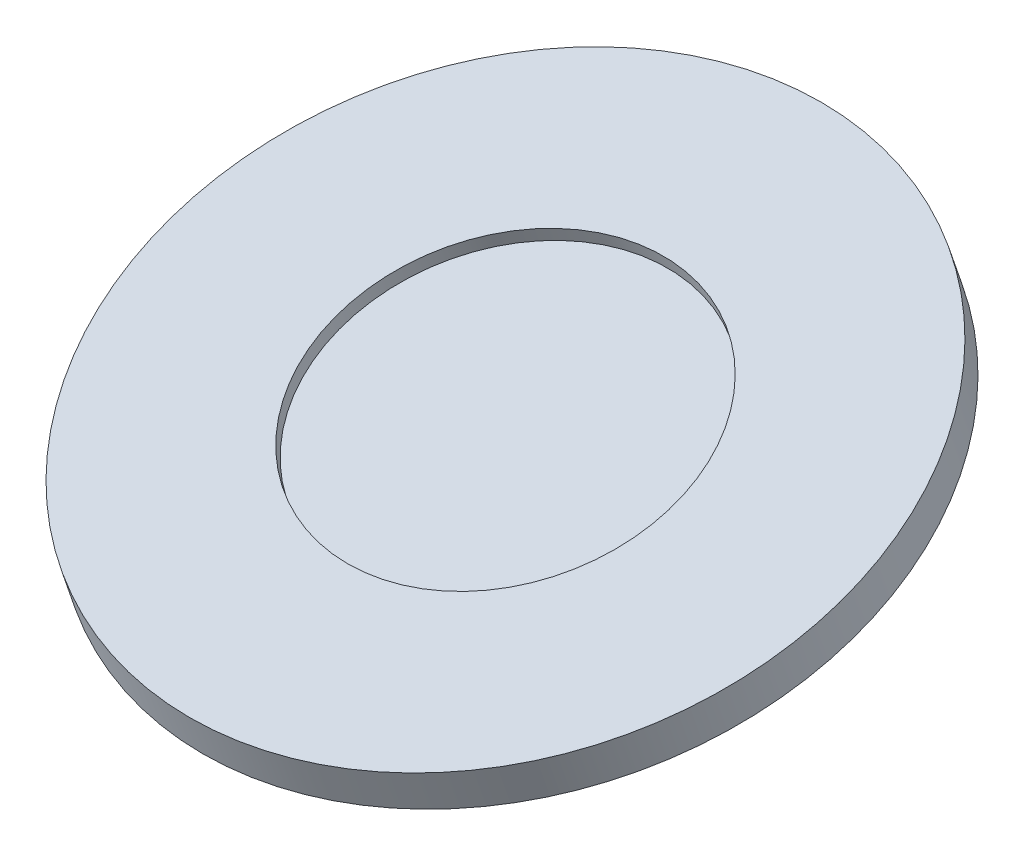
ISO-10303-21;
HEADER;
FILE_DESCRIPTION(('STEP AP214'),'2;1');
FILE_NAME('part.step','',(''),(''),'','','');
FILE_SCHEMA(('AUTOMOTIVE_DESIGN { 1 0 10303 214 1 1 1 1 }'));
ENDSEC;
DATA;
#1=APPLICATION_CONTEXT('core data for automotive mechanical design processes');
#2=APPLICATION_PROTOCOL_DEFINITION('international standard','automotive_design',2000,#1);
#3=PRODUCT_CONTEXT('',#1,'mechanical');
#4=PRODUCT('Part','Part','',(#3));
#5=PRODUCT_RELATED_PRODUCT_CATEGORY('part','',(#4));
#6=PRODUCT_DEFINITION_FORMATION('','',#4);
#7=PRODUCT_DEFINITION_CONTEXT('part definition',#1,'design');
#8=PRODUCT_DEFINITION('design','',#6,#7);
#9=PRODUCT_DEFINITION_SHAPE('','',#8);
#10=(LENGTH_UNIT() NAMED_UNIT(*) SI_UNIT(.MILLI.,.METRE.));
#11=(NAMED_UNIT(*) PLANE_ANGLE_UNIT() SI_UNIT($,.RADIAN.));
#12=(NAMED_UNIT(*) SI_UNIT($,.STERADIAN.) SOLID_ANGLE_UNIT());
#13=UNCERTAINTY_MEASURE_WITH_UNIT(LENGTH_MEASURE(1.E-05),#10,'distance_accuracy_value','');
#14=(GEOMETRIC_REPRESENTATION_CONTEXT(3) GLOBAL_UNCERTAINTY_ASSIGNED_CONTEXT((#13)) GLOBAL_UNIT_ASSIGNED_CONTEXT((#10,
#11,#12)) REPRESENTATION_CONTEXT('',''));
#15=CARTESIAN_POINT('',(0.,0.,0.));
#16=DIRECTION('',(0.,0.,1.));
#17=DIRECTION('',(1.,0.,0.));
#18=AXIS2_PLACEMENT_3D('',#15,#16,#17);
#19=CARTESIAN_POINT('',(-782.657553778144,-241.231311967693,-449.243524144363));
#20=DIRECTION('',(0.,-0.945518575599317,-0.325568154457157));
#21=DIRECTION('',(0.,0.325568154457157,-0.945518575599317));
#22=AXIS2_PLACEMENT_3D('',#19,#20,#21);
#23=PLANE('',#22);
#24=CARTESIAN_POINT('',(-782.657553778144,-241.231311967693,-449.243524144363));
#25=DIRECTION('',(0.,0.945518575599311,0.325568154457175));
#26=DIRECTION('',(0.,-0.325568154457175,0.945518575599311));
#27=AXIS2_PLACEMENT_3D('',#24,#25,#26);
#28=CIRCLE('',#27,6.35000000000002);
#29=CARTESIAN_POINT('',(-782.657553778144,-243.298669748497,-443.239481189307));
#30=VERTEX_POINT('',#29);
#31=EDGE_CURVE('E18',#30,#30,#28,.T.);
#32=ORIENTED_EDGE('',*,*,#31,.T.);
#33=EDGE_LOOP('',(#32));
#34=FACE_BOUND('',#33,.T.);
#35=ADVANCED_FACE('F15',(#34),#23,.F.);
#36=CARTESIAN_POINT('',(-782.657553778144,-241.231311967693,-449.243524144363));
#37=DIRECTION('',(0.,0.945518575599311,0.325568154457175));
#38=DIRECTION('',(0.,-0.325568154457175,0.945518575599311));
#39=AXIS2_PLACEMENT_3D('',#36,#37,#38);
#40=CYLINDRICAL_SURFACE('',#39,6.35000000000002);
#41=ORIENTED_EDGE('',*,*,#31,.F.);
#42=EDGE_LOOP('',(#41));
#43=FACE_BOUND('',#42,.T.);
#44=CARTESIAN_POINT('',(-782.657553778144,-240.750988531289,-449.078135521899));
#45=DIRECTION('',(0.,0.945518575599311,0.325568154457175));
#46=DIRECTION('',(0.,-0.325568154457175,0.945518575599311));
#47=AXIS2_PLACEMENT_3D('',#44,#45,#46);
#48=CIRCLE('',#47,6.35000000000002);
#49=CARTESIAN_POINT('',(-782.657553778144,-242.818346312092,-443.074092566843));
#50=VERTEX_POINT('',#49);
#51=EDGE_CURVE('E34',#50,#50,#48,.F.);
#52=ORIENTED_EDGE('',*,*,#51,.F.);
#53=EDGE_LOOP('',(#52));
#54=FACE_BOUND('',#53,.T.);
#55=ADVANCED_FACE('F42',(#43,#54),#40,.F.);
#56=CARTESIAN_POINT('',(-782.657553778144,-246.694991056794,-451.124819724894));
#57=DIRECTION('',(0.,-0.945518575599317,-0.325568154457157));
#58=DIRECTION('',(0.,0.325568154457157,-0.945518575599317));
#59=AXIS2_PLACEMENT_3D('',#56,#57,#58);
#60=PLANE('',#59);
#61=CARTESIAN_POINT('',(-782.657553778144,-246.694991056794,-451.124819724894));
#62=DIRECTION('',(0.,0.945518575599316,0.325568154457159));
#63=DIRECTION('',(0.,-0.325568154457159,0.945518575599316));
#64=AXIS2_PLACEMENT_3D('',#61,#62,#63);
#65=CIRCLE('',#64,6.35000000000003);
#66=CARTESIAN_POINT('',(-782.657553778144,-248.762348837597,-445.120776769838));
#67=VERTEX_POINT('',#66);
#68=EDGE_CURVE('E32',#67,#67,#65,.T.);
#69=ORIENTED_EDGE('',*,*,#68,.F.);
#70=EDGE_LOOP('',(#69));
#71=FACE_BOUND('',#70,.T.);
#72=ADVANCED_FACE('F45',(#71),#60,.T.);
#73=CARTESIAN_POINT('',(-782.657553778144,-240.750988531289,-449.078135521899));
#74=DIRECTION('',(0.,0.945518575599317,0.325568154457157));
#75=DIRECTION('',(0.,-0.325568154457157,0.945518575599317));
#76=AXIS2_PLACEMENT_3D('',#73,#74,#75);
#77=PLANE('',#76);
#78=ORIENTED_EDGE('',*,*,#51,.T.);
#79=EDGE_LOOP('',(#78));
#80=FACE_BOUND('',#79,.T.);
#81=CARTESIAN_POINT('',(-782.657553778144,-240.750988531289,-449.078135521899));
#82=DIRECTION('',(0.,0.945518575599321,0.325568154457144));
#83=DIRECTION('',(0.,-0.325568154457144,0.945518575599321));
#84=AXIS2_PLACEMENT_3D('',#81,#82,#83);
#85=CIRCLE('',#84,12.7);
#86=CARTESIAN_POINT('',(-782.657553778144,-244.885704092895,-437.070049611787));
#87=VERTEX_POINT('',#86);
#88=EDGE_CURVE('E27',#87,#87,#85,.F.);
#89=ORIENTED_EDGE('',*,*,#88,.F.);
#90=EDGE_LOOP('',(#89));
#91=FACE_BOUND('',#90,.T.);
#92=ADVANCED_FACE('F51',(#80,#91),#77,.T.);
#93=CARTESIAN_POINT('',(-782.657553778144,-246.694991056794,-451.124819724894));
#94=DIRECTION('',(0.,0.945518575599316,0.325568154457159));
#95=DIRECTION('',(0.,-0.325568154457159,0.945518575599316));
#96=AXIS2_PLACEMENT_3D('',#93,#94,#95);
#97=CYLINDRICAL_SURFACE('',#96,6.35000000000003);
#98=CARTESIAN_POINT('',(-782.657553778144,-242.191958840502,-449.574301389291));
#99=DIRECTION('',(0.,0.945518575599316,0.325568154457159));
#100=DIRECTION('',(0.,-0.325568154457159,0.945518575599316));
#101=AXIS2_PLACEMENT_3D('',#98,#99,#100);
#102=CIRCLE('',#101,6.35000000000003);
#103=CARTESIAN_POINT('',(-782.657553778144,-244.259316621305,-443.570258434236));
#104=VERTEX_POINT('',#103);
#105=EDGE_CURVE('E22',#104,#104,#102,.T.);
#106=ORIENTED_EDGE('',*,*,#105,.F.);
#107=EDGE_LOOP('',(#106));
#108=FACE_BOUND('',#107,.T.);
#109=ORIENTED_EDGE('',*,*,#68,.T.);
#110=EDGE_LOOP('',(#109));
#111=FACE_BOUND('',#110,.T.);
#112=ADVANCED_FACE('F61',(#108,#111),#97,.T.);
#113=CARTESIAN_POINT('',(-782.657553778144,-242.191958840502,-449.574301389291));
#114=DIRECTION('',(0.,0.945518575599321,0.325568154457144));
#115=DIRECTION('',(0.,-0.325568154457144,0.945518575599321));
#116=AXIS2_PLACEMENT_3D('',#113,#114,#115);
#117=CYLINDRICAL_SURFACE('',#116,12.7);
#118=ORIENTED_EDGE('',*,*,#88,.T.);
#119=EDGE_LOOP('',(#118));
#120=FACE_BOUND('',#119,.T.);
#121=CARTESIAN_POINT('',(-782.657553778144,-242.191958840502,-449.574301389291));
#122=DIRECTION('',(0.,0.945518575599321,0.325568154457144));
#123=DIRECTION('',(0.,-0.325568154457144,0.945518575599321));
#124=AXIS2_PLACEMENT_3D('',#121,#122,#123);
#125=CIRCLE('',#124,12.7);
#126=CARTESIAN_POINT('',(-782.657553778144,-246.326674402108,-437.56621547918));
#127=VERTEX_POINT('',#126);
#128=EDGE_CURVE('E10',#127,#127,#125,.F.);
#129=ORIENTED_EDGE('',*,*,#128,.F.);
#130=EDGE_LOOP('',(#129));
#131=FACE_BOUND('',#130,.T.);
#132=ADVANCED_FACE('F56',(#120,#131),#117,.T.);
#133=CARTESIAN_POINT('',(-782.657553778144,-242.191958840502,-449.574301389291));
#134=DIRECTION('',(0.,-0.945518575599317,-0.325568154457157));
#135=DIRECTION('',(0.,0.325568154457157,-0.945518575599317));
#136=AXIS2_PLACEMENT_3D('',#133,#134,#135);
#137=PLANE('',#136);
#138=ORIENTED_EDGE('',*,*,#128,.T.);
#139=EDGE_LOOP('',(#138));
#140=FACE_BOUND('',#139,.T.);
#141=ORIENTED_EDGE('',*,*,#105,.T.);
#142=EDGE_LOOP('',(#141));
#143=FACE_BOUND('',#142,.T.);
#144=ADVANCED_FACE('F54',(#140,#143),#137,.T.);
#145=CLOSED_SHELL('',(#35,#55,#72,#92,#112,#132,#144));
#146=MANIFOLD_SOLID_BREP('B1',#145);
#147=ADVANCED_BREP_SHAPE_REPRESENTATION('',(#18,#146),#14);
#148=SHAPE_DEFINITION_REPRESENTATION(#9,#147);
ENDSEC;
END-ISO-10303-21;
